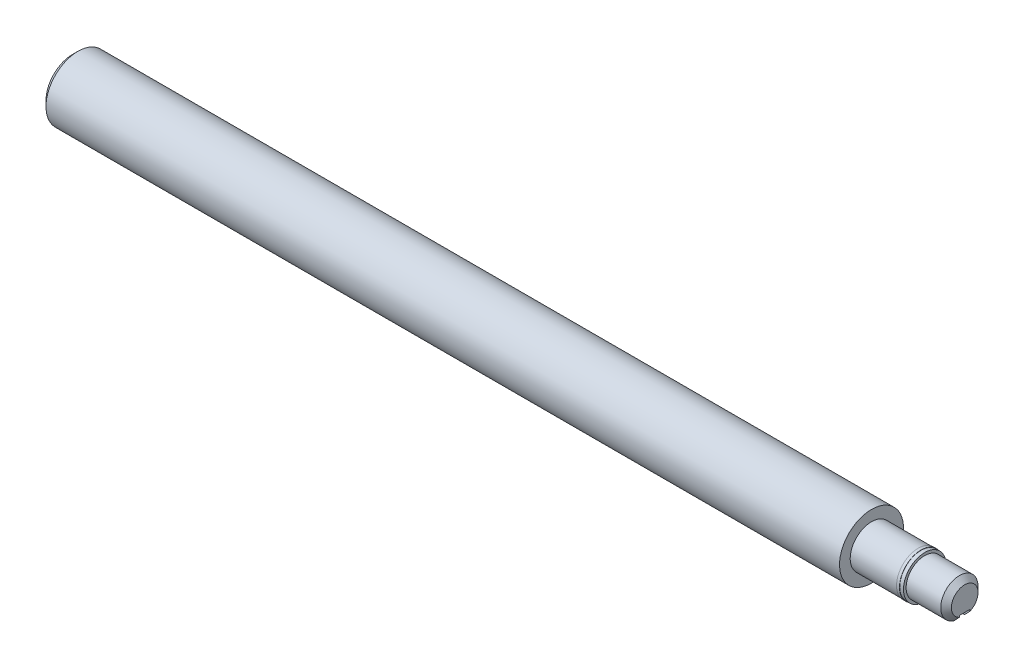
ISO-10303-21;
HEADER;
FILE_DESCRIPTION(('STEP AP214'),'2;1');
FILE_NAME('part.step','',(''),(''),'','','');
FILE_SCHEMA(('AUTOMOTIVE_DESIGN { 1 0 10303 214 1 1 1 1 }'));
ENDSEC;
DATA;
#1=APPLICATION_CONTEXT('core data for automotive mechanical design processes');
#2=APPLICATION_PROTOCOL_DEFINITION('international standard','automotive_design',2000,#1);
#3=PRODUCT_CONTEXT('',#1,'mechanical');
#4=PRODUCT('Part','Part','',(#3));
#5=PRODUCT_RELATED_PRODUCT_CATEGORY('part','',(#4));
#6=PRODUCT_DEFINITION_FORMATION('','',#4);
#7=PRODUCT_DEFINITION_CONTEXT('part definition',#1,'design');
#8=PRODUCT_DEFINITION('design','',#6,#7);
#9=PRODUCT_DEFINITION_SHAPE('','',#8);
#10=(LENGTH_UNIT() NAMED_UNIT(*) SI_UNIT(.MILLI.,.METRE.));
#11=(NAMED_UNIT(*) PLANE_ANGLE_UNIT() SI_UNIT($,.RADIAN.));
#12=(NAMED_UNIT(*) SI_UNIT($,.STERADIAN.) SOLID_ANGLE_UNIT());
#13=UNCERTAINTY_MEASURE_WITH_UNIT(LENGTH_MEASURE(1.E-05),#10,'distance_accuracy_value','');
#14=(GEOMETRIC_REPRESENTATION_CONTEXT(3) GLOBAL_UNCERTAINTY_ASSIGNED_CONTEXT((#13)) GLOBAL_UNIT_ASSIGNED_CONTEXT((#10,
#11,#12)) REPRESENTATION_CONTEXT('',''));
#15=CARTESIAN_POINT('',(0.,0.,0.));
#16=DIRECTION('',(0.,0.,1.));
#17=DIRECTION('',(1.,0.,0.));
#18=AXIS2_PLACEMENT_3D('',#15,#16,#17);
#19=CARTESIAN_POINT('',(335.,3.50000000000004,0.));
#20=DIRECTION('',(1.,0.,0.));
#21=DIRECTION('',(0.,0.,-1.));
#22=AXIS2_PLACEMENT_3D('',#19,#20,#21);
#23=PLANE('',#22);
#24=CARTESIAN_POINT('',(335.000000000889,0.,0.));
#25=DIRECTION('',(-1.,0.,0.));
#26=DIRECTION('',(0.,0.,1.));
#27=AXIS2_PLACEMENT_3D('',#24,#25,#26);
#28=CIRCLE('',#27,5.00000000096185);
#29=CARTESIAN_POINT('',(335.000000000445,-4.58257569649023,2.00000000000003));
#30=VERTEX_POINT('',#29);
#31=CARTESIAN_POINT('',(335.000000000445,-4.58257569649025,-1.99999999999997));
#32=VERTEX_POINT('',#31);
#33=EDGE_CURVE('E84',#30,#32,#28,.T.);
#34=ORIENTED_EDGE('',*,*,#33,.F.);
#35=DIRECTION('',(0.,1.,0.));
#36=VECTOR('',#35,1.);
#37=CARTESIAN_POINT('',(335.,-6.99999999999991,2.00000000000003));
#38=LINE('',#37,#36);
#39=CARTESIAN_POINT('',(335.,-3.99999999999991,2.00000000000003));
#40=VERTEX_POINT('',#39);
#41=EDGE_CURVE('E83',#30,#40,#38,.T.);
#42=ORIENTED_EDGE('',*,*,#41,.T.);
#43=DIRECTION('',(0.,0.,1.));
#44=VECTOR('',#43,1.);
#45=CARTESIAN_POINT('',(335.,-3.99999999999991,0.));
#46=LINE('',#45,#44);
#47=CARTESIAN_POINT('',(335.,-3.99999999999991,-1.99999999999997));
#48=VERTEX_POINT('',#47);
#49=EDGE_CURVE('E110',#40,#48,#46,.F.);
#50=ORIENTED_EDGE('',*,*,#49,.T.);
#51=DIRECTION('',(0.,1.,0.));
#52=VECTOR('',#51,1.);
#53=CARTESIAN_POINT('',(335.,3.50000000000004,-1.99999999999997));
#54=LINE('',#53,#52);
#55=EDGE_CURVE('E113',#48,#32,#54,.F.);
#56=ORIENTED_EDGE('',*,*,#55,.T.);
#57=EDGE_LOOP('',(#34,#42,#50,#56));
#58=FACE_BOUND('',#57,.T.);
#59=ADVANCED_FACE('F16',(#58),#23,.T.);
#60=CARTESIAN_POINT('',(329.787704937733,-3.99999999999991,0.));
#61=DIRECTION('',(0.,1.,0.));
#62=DIRECTION('',(0.,0.,1.));
#63=AXIS2_PLACEMENT_3D('',#60,#61,#62);
#64=PLANE('',#63);
#65=DIRECTION('',(1.,0.,0.));
#66=VECTOR('',#65,1.);
#67=CARTESIAN_POINT('',(337.815182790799,-3.99999999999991,2.00000000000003));
#68=LINE('',#67,#66);
#69=CARTESIAN_POINT('',(323.,-3.99999999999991,2.00000000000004));
#70=VERTEX_POINT('',#69);
#71=EDGE_CURVE('E85',#40,#70,#68,.F.);
#72=ORIENTED_EDGE('',*,*,#71,.T.);
#73=CARTESIAN_POINT('',(323.,-3.99999999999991,0.));
#74=DIRECTION('',(0.,1.,0.));
#75=DIRECTION('',(0.,0.,1.));
#76=AXIS2_PLACEMENT_3D('',#73,#74,#75);
#77=CIRCLE('',#76,2.);
#78=CARTESIAN_POINT('',(323.,-3.99999999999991,-1.99999999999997));
#79=VERTEX_POINT('',#78);
#80=EDGE_CURVE('E91',#70,#79,#77,.F.);
#81=ORIENTED_EDGE('',*,*,#80,.T.);
#82=DIRECTION('',(-1.,0.,0.));
#83=VECTOR('',#82,1.);
#84=CARTESIAN_POINT('',(323.,-3.99999999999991,-1.99999999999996));
#85=LINE('',#84,#83);
#86=EDGE_CURVE('E102',#79,#48,#85,.F.);
#87=ORIENTED_EDGE('',*,*,#86,.T.);
#88=ORIENTED_EDGE('',*,*,#49,.F.);
#89=EDGE_LOOP('',(#72,#81,#87,#88));
#90=FACE_BOUND('',#89,.T.);
#91=ADVANCED_FACE('F212',(#90),#64,.F.);
#92=CARTESIAN_POINT('',(337.815182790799,-6.99999999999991,2.00000000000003));
#93=DIRECTION('',(0.,0.,1.));
#94=DIRECTION('',(1.,0.,0.));
#95=AXIS2_PLACEMENT_3D('',#92,#93,#94);
#96=PLANE('',#95);
#97=DIRECTION('',(0.,1.,0.));
#98=VECTOR('',#97,1.);
#99=CARTESIAN_POINT('',(323.,-6.99999999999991,2.00000000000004));
#100=LINE('',#99,#98);
#101=CARTESIAN_POINT('',(323.,-6.70820393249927,2.00000000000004));
#102=VERTEX_POINT('',#101);
#103=EDGE_CURVE('E95',#102,#70,#100,.T.);
#104=ORIENTED_EDGE('',*,*,#103,.T.);
#105=ORIENTED_EDGE('',*,*,#71,.F.);
#106=ORIENTED_EDGE('',*,*,#41,.F.);
#107=CARTESIAN_POINT('',(332.99999999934,-6.70820393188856,2.00000000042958));
#108=CARTESIAN_POINT('',(333.168277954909,-6.53258975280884,2.00000000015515));
#109=CARTESIAN_POINT('',(333.336291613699,-6.35672115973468,2.00000000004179));
#110=CARTESIAN_POINT('',(333.671595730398,-6.0043059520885,1.99999999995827));
#111=CARTESIAN_POINT('',(333.838886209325,-5.82775935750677,1.9999999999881));
#112=CARTESIAN_POINT('',(334.172561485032,-5.47380630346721,2.00000000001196));
#113=CARTESIAN_POINT('',(334.338946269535,-5.29639983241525,2.000000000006));
#114=CARTESIAN_POINT('',(334.670482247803,-4.94042885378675,1.99999999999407));
#115=CARTESIAN_POINT('',(334.835633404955,-4.76186431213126,1.9999999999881));
#116=CARTESIAN_POINT('',(335.000000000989,-4.58257569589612,2.00000000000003));
#117=B_SPLINE_CURVE_WITH_KNOTS('',3,(#107,#108,#109,#110,#111,#112,#113,#114,#115,#116),
.UNSPECIFIED.,.F.,.F.,(4,2,2,2,4),(0.,0.729672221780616,1.45932309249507,2.18898382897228,
2.91866613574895),.UNSPECIFIED.);
#118=CARTESIAN_POINT('',(332.999999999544,-6.70820393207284,2.00000000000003));
#119=VERTEX_POINT('',#118);
#120=EDGE_CURVE('E20',#119,#30,#117,.T.);
#121=ORIENTED_EDGE('',*,*,#120,.F.);
#122=DIRECTION('',(1.,0.,0.));
#123=VECTOR('',#122,1.);
#124=CARTESIAN_POINT('',(327.5,-6.70820393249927,2.00000000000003));
#125=LINE('',#124,#123);
#126=EDGE_CURVE('E74',#102,#119,#125,.T.);
#127=ORIENTED_EDGE('',*,*,#126,.F.);
#128=EDGE_LOOP('',(#104,#105,#106,#121,#127));
#129=FACE_BOUND('',#128,.T.);
#130=ADVANCED_FACE('F80',(#129),#96,.F.);
#131=CARTESIAN_POINT('',(332.999999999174,0.,0.));
#132=DIRECTION('',(-1.,0.,0.));
#133=DIRECTION('',(0.,0.,1.));
#134=AXIS2_PLACEMENT_3D('',#131,#132,#133);
#135=CONICAL_SURFACE('',#134,6.99999999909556,0.785398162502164);
#136=CARTESIAN_POINT('',(335.000000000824,-4.58257569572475,-1.99999999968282));
#137=CARTESIAN_POINT('',(334.835633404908,-4.76186431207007,-1.99999999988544));
#138=CARTESIAN_POINT('',(334.670482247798,-4.94042885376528,-1.99999999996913));
#139=CARTESIAN_POINT('',(334.338946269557,-5.29639983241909,-2.0000000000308));
#140=CARTESIAN_POINT('',(334.172561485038,-5.47380630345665,-2.00000000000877));
#141=CARTESIAN_POINT('',(333.838886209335,-5.82775935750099,-1.99999999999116));
#142=CARTESIAN_POINT('',(333.671595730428,-6.0043059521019,-1.99999999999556));
#143=CARTESIAN_POINT('',(333.336291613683,-6.35672115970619,-2.00000000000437));
#144=CARTESIAN_POINT('',(333.168277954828,-6.53258975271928,-2.00000000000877));
#145=CARTESIAN_POINT('',(332.999999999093,-6.7082039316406,-1.99999999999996));
#146=B_SPLINE_CURVE_WITH_KNOTS('',3,(#136,#137,#138,#139,#140,#141,#142,#143,#144,#145),
.UNSPECIFIED.,.F.,.F.,(4,2,2,2,4),(0.,0.729682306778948,1.45934304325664,2.18899391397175,
2.91866613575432),.UNSPECIFIED.);
#147=CARTESIAN_POINT('',(332.999999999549,-6.70820393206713,-1.99999999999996));
#148=VERTEX_POINT('',#147);
#149=EDGE_CURVE('E69',#32,#148,#146,.T.);
#150=ORIENTED_EDGE('',*,*,#149,.T.);
#151=CARTESIAN_POINT('',(333.,0.,0.));
#152=DIRECTION('',(1.,0.,0.));
#153=DIRECTION('',(0.,1.,0.));
#154=AXIS2_PLACEMENT_3D('',#151,#152,#153);
#155=CIRCLE('',#154,6.99999999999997);
#156=EDGE_CURVE('E64',#119,#148,#155,.F.);
#157=ORIENTED_EDGE('',*,*,#156,.F.);
#158=ORIENTED_EDGE('',*,*,#120,.T.);
#159=ORIENTED_EDGE('',*,*,#33,.T.);
#160=EDGE_LOOP('',(#150,#157,#158,#159));
#161=FACE_BOUND('',#160,.T.);
#162=ADVANCED_FACE('F66',(#161),#135,.T.);
#163=CARTESIAN_POINT('',(323.,-6.99999999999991,-1.99999999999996));
#164=DIRECTION('',(0.,0.,-1.));
#165=DIRECTION('',(-1.,0.,0.));
#166=AXIS2_PLACEMENT_3D('',#163,#164,#165);
#167=PLANE('',#166);
#168=ORIENTED_EDGE('',*,*,#149,.F.);
#169=ORIENTED_EDGE('',*,*,#55,.F.);
#170=ORIENTED_EDGE('',*,*,#86,.F.);
#171=DIRECTION('',(0.,1.,0.));
#172=VECTOR('',#171,1.);
#173=CARTESIAN_POINT('',(323.,-6.99999999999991,-1.99999999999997));
#174=LINE('',#173,#172);
#175=CARTESIAN_POINT('',(323.,-6.70820393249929,-1.99999999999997));
#176=VERTEX_POINT('',#175);
#177=EDGE_CURVE('E40',#79,#176,#174,.F.);
#178=ORIENTED_EDGE('',*,*,#177,.T.);
#179=DIRECTION('',(1.,0.,0.));
#180=VECTOR('',#179,1.);
#181=CARTESIAN_POINT('',(327.5,-6.70820393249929,-1.99999999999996));
#182=LINE('',#181,#180);
#183=EDGE_CURVE('E73',#148,#176,#182,.F.);
#184=ORIENTED_EDGE('',*,*,#183,.F.);
#185=EDGE_LOOP('',(#168,#169,#170,#178,#184));
#186=FACE_BOUND('',#185,.T.);
#187=ADVANCED_FACE('F204',(#186),#167,.F.);
#188=CARTESIAN_POINT('',(323.,-6.99999999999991,0.));
#189=DIRECTION('',(0.,1.,0.));
#190=DIRECTION('',(0.,0.,1.));
#191=AXIS2_PLACEMENT_3D('',#188,#189,#190);
#192=CYLINDRICAL_SURFACE('',#191,2.);
#193=CARTESIAN_POINT('',(323.,-6.70820393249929,-1.99999999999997));
#194=CARTESIAN_POINT('',(322.944965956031,-6.70819953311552,-2.00000099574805));
#195=CARTESIAN_POINT('',(322.889959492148,-6.70888204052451,-1.99772698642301));
#196=CARTESIAN_POINT('',(322.780363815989,-6.71157572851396,-1.98866402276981));
#197=CARTESIAN_POINT('',(322.725774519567,-6.71358663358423,-1.98187600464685));
#198=CARTESIAN_POINT('',(322.563492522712,-6.7215274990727,-1.95485063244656));
#199=CARTESIAN_POINT('',(322.456924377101,-6.7293661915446,-1.927951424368));
#200=CARTESIAN_POINT('',(322.250058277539,-6.74920546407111,-1.85729706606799));
#201=CARTESIAN_POINT('',(322.149758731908,-6.76120498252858,-1.81354621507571));
#202=CARTESIAN_POINT('',(321.957860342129,-6.78800553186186,-1.71049896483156));
#203=CARTESIAN_POINT('',(321.866264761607,-6.80280760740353,-1.65119676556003));
#204=CARTESIAN_POINT('',(321.691817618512,-6.83401592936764,-1.51693301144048));
#205=CARTESIAN_POINT('',(321.609251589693,-6.85045364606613,-1.44160788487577));
#206=CARTESIAN_POINT('',(321.457713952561,-6.88281585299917,-1.27819153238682));
#207=CARTESIAN_POINT('',(321.38874717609,-6.89874015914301,-1.19009578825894));
#208=CARTESIAN_POINT('',(321.26513970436,-6.92864106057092,-1.00160024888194));
#209=CARTESIAN_POINT('',(321.2107959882,-6.94257491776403,-0.900998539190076));
#210=CARTESIAN_POINT('',(321.119959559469,-6.96653558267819,-0.691686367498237));
#211=CARTESIAN_POINT('',(321.08344524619,-6.97656711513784,-0.582985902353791));
#212=CARTESIAN_POINT('',(321.037748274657,-6.98928636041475,-0.394805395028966));
#213=CARTESIAN_POINT('',(321.023618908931,-6.99328251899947,-0.316579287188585));
#214=CARTESIAN_POINT('',(321.004743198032,-6.99864042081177,-0.158912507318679));
#215=CARTESIAN_POINT('',(320.999996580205,-7.00000224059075,-0.0794718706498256));
#216=CARTESIAN_POINT('',(321.000004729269,-6.99999690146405,0.109902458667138));
#217=CARTESIAN_POINT('',(321.009093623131,-6.99738511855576,0.219864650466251));
#218=CARTESIAN_POINT('',(321.045149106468,-6.98721356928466,0.436640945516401));
#219=CARTESIAN_POINT('',(321.072132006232,-6.97964928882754,0.54345208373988));
#220=CARTESIAN_POINT('',(321.143009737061,-6.96040637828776,0.750707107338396));
#221=CARTESIAN_POINT('',(321.186877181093,-6.94873441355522,0.851160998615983));
#222=CARTESIAN_POINT('',(321.290183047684,-6.92249857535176,1.04327701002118));
#223=CARTESIAN_POINT('',(321.349621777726,-6.90793464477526,1.13493895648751));
#224=CARTESIAN_POINT('',(321.484033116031,-6.87704774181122,1.30929206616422));
#225=CARTESIAN_POINT('',(321.559340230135,-6.86069128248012,1.39171940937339));
#226=CARTESIAN_POINT('',(321.722644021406,-6.82826812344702,1.5429680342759));
#227=CARTESIAN_POINT('',(321.810643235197,-6.81220148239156,1.61178658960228));
#228=CARTESIAN_POINT('',(321.999020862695,-6.78182545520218,1.73521711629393));
#229=CARTESIAN_POINT('',(322.099615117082,-6.76755858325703,1.7895107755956));
#230=CARTESIAN_POINT('',(322.308951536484,-6.74290625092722,1.88027667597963));
#231=CARTESIAN_POINT('',(322.41768673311,-6.73251751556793,1.91676396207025));
#232=CARTESIAN_POINT('',(322.605808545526,-6.71933727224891,1.9623687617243));
#233=CARTESIAN_POINT('',(322.683931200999,-6.7151917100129,1.97645330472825));
#234=CARTESIAN_POINT('',(322.841353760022,-6.70961199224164,1.99527750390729));
#235=CARTESIAN_POINT('',(322.920653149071,-6.70817668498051,2.00002112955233));
#236=CARTESIAN_POINT('',(323.,-6.70820393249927,2.00000000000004));
#237=B_SPLINE_CURVE_WITH_KNOTS('',3,(#193,#194,#195,#196,#197,#198,#199,#200,#201,#202,#203,
#204,#205,#206,#207,#208,#209,#210,#211,#212,#213,#214,#215,#216,#217,#218,#219,#220,#221,#222,
#223,#224,#225,#226,#227,#228,#229,#230,#231,#232,#233,#234,#235,#236),.UNSPECIFIED.,.F.,.F.,(4,
2,2,2,2,2,2,2,2,2,2,2,2,2,2,2,2,2,2,2,2,4),(0.,0.164996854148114,0.329959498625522,
0.658815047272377,0.987586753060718,1.31648125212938,1.65383602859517,1.99131045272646,
2.33519463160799,2.67866114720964,2.91686961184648,3.15507115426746,3.48448249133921,
3.81419449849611,4.14337394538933,4.47255989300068,4.8095407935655,5.14658913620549,
5.49051045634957,5.83414068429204,6.0720400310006,6.30983825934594),.UNSPECIFIED.);
#238=EDGE_CURVE('E88',#176,#102,#237,.T.);
#239=ORIENTED_EDGE('',*,*,#238,.F.);
#240=ORIENTED_EDGE('',*,*,#177,.F.);
#241=ORIENTED_EDGE('',*,*,#80,.F.);
#242=ORIENTED_EDGE('',*,*,#103,.F.);
#243=EDGE_LOOP('',(#239,#240,#241,#242));
#244=FACE_BOUND('',#243,.T.);
#245=ADVANCED_FACE('F146',(#244),#192,.F.);
#246=CARTESIAN_POINT('',(327.5,0.,0.));
#247=DIRECTION('',(1.,0.,0.));
#248=DIRECTION('',(0.,1.,0.));
#249=AXIS2_PLACEMENT_3D('',#246,#247,#248);
#250=CYLINDRICAL_SURFACE('',#249,6.99999999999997);
#251=ORIENTED_EDGE('',*,*,#126,.T.);
#252=ORIENTED_EDGE('',*,*,#156,.T.);
#253=ORIENTED_EDGE('',*,*,#183,.T.);
#254=ORIENTED_EDGE('',*,*,#238,.T.);
#255=EDGE_LOOP('',(#251,#252,#253,#254));
#256=FACE_BOUND('',#255,.T.);
#257=CARTESIAN_POINT('',(320.,0.,0.));
#258=DIRECTION('',(1.,0.,0.));
#259=DIRECTION('',(0.,1.,0.));
#260=AXIS2_PLACEMENT_3D('',#257,#258,#259);
#261=CIRCLE('',#260,6.99999999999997);
#262=CARTESIAN_POINT('',(320.,7.00000000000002,0.));
#263=VERTEX_POINT('',#262);
#264=EDGE_CURVE('E136',#263,#263,#261,.F.);
#265=ORIENTED_EDGE('',*,*,#264,.F.);
#266=EDGE_LOOP('',(#265));
#267=FACE_BOUND('',#266,.T.);
#268=ADVANCED_FACE('F86',(#256,#267),#250,.T.);
#269=CARTESIAN_POINT('',(320.,7.50000000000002,0.));
#270=DIRECTION('',(1.,0.,0.));
#271=DIRECTION('',(0.,0.,-1.));
#272=AXIS2_PLACEMENT_3D('',#269,#270,#271);
#273=PLANE('',#272);
#274=ORIENTED_EDGE('',*,*,#264,.T.);
#275=EDGE_LOOP('',(#274));
#276=FACE_BOUND('',#275,.T.);
#277=CARTESIAN_POINT('',(320.,0.,0.));
#278=DIRECTION('',(1.,0.,0.));
#279=DIRECTION('',(0.,1.,0.));
#280=AXIS2_PLACEMENT_3D('',#277,#278,#279);
#281=CIRCLE('',#280,7.99999999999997);
#282=CARTESIAN_POINT('',(320.,8.00000000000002,0.));
#283=VERTEX_POINT('',#282);
#284=EDGE_CURVE('E133',#283,#283,#281,.F.);
#285=ORIENTED_EDGE('',*,*,#284,.F.);
#286=EDGE_LOOP('',(#285));
#287=FACE_BOUND('',#286,.T.);
#288=ADVANCED_FACE('F152',(#276,#287),#273,.T.);
#289=CARTESIAN_POINT('',(319.3,0.,0.));
#290=DIRECTION('',(1.,0.,0.));
#291=DIRECTION('',(0.,1.,0.));
#292=AXIS2_PLACEMENT_3D('',#289,#290,#291);
#293=CYLINDRICAL_SURFACE('',#292,7.99999999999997);
#294=ORIENTED_EDGE('',*,*,#284,.T.);
#295=EDGE_LOOP('',(#294));
#296=FACE_BOUND('',#295,.T.);
#297=CARTESIAN_POINT('',(318.6,0.,0.));
#298=DIRECTION('',(1.,0.,0.));
#299=DIRECTION('',(0.,1.,0.));
#300=AXIS2_PLACEMENT_3D('',#297,#298,#299);
#301=CIRCLE('',#300,7.99999999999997);
#302=CARTESIAN_POINT('',(318.6,8.00000000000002,0.));
#303=VERTEX_POINT('',#302);
#304=EDGE_CURVE('E130',#303,#303,#301,.F.);
#305=ORIENTED_EDGE('',*,*,#304,.F.);
#306=EDGE_LOOP('',(#305));
#307=FACE_BOUND('',#306,.T.);
#308=ADVANCED_FACE('F155',(#296,#307),#293,.T.);
#309=CARTESIAN_POINT('',(318.6,8.05000000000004,0.));
#310=DIRECTION('',(1.,0.,0.));
#311=DIRECTION('',(0.,0.,-1.));
#312=AXIS2_PLACEMENT_3D('',#309,#310,#311);
#313=PLANE('',#312);
#314=ORIENTED_EDGE('',*,*,#304,.T.);
#315=EDGE_LOOP('',(#314));
#316=FACE_BOUND('',#315,.T.);
#317=CARTESIAN_POINT('',(318.6,0.,0.));
#318=DIRECTION('',(1.,0.,0.));
#319=DIRECTION('',(0.,1.,0.));
#320=AXIS2_PLACEMENT_3D('',#317,#318,#319);
#321=CIRCLE('',#320,8.1);
#322=CARTESIAN_POINT('',(318.6,8.10000000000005,0.));
#323=VERTEX_POINT('',#322);
#324=EDGE_CURVE('E127',#323,#323,#321,.F.);
#325=ORIENTED_EDGE('',*,*,#324,.F.);
#326=EDGE_LOOP('',(#325));
#327=FACE_BOUND('',#326,.T.);
#328=ADVANCED_FACE('F159',(#316,#327),#313,.T.);
#329=CARTESIAN_POINT('',(318.05,0.,0.));
#330=DIRECTION('',(1.,0.,0.));
#331=DIRECTION('',(0.,1.,0.));
#332=AXIS2_PLACEMENT_3D('',#329,#330,#331);
#333=CYLINDRICAL_SURFACE('',#332,8.1);
#334=ORIENTED_EDGE('',*,*,#324,.T.);
#335=EDGE_LOOP('',(#334));
#336=FACE_BOUND('',#335,.T.);
#337=CARTESIAN_POINT('',(317.5,0.,0.));
#338=DIRECTION('',(1.,0.,0.));
#339=DIRECTION('',(0.,1.,0.));
#340=AXIS2_PLACEMENT_3D('',#337,#338,#339);
#341=CIRCLE('',#340,8.1);
#342=CARTESIAN_POINT('',(317.5,8.10000000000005,0.));
#343=VERTEX_POINT('',#342);
#344=EDGE_CURVE('E124',#343,#343,#341,.F.);
#345=ORIENTED_EDGE('',*,*,#344,.F.);
#346=EDGE_LOOP('',(#345));
#347=FACE_BOUND('',#346,.T.);
#348=ADVANCED_FACE('F163',(#336,#347),#333,.T.);
#349=CARTESIAN_POINT('',(317.5,8.05000000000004,0.));
#350=DIRECTION('',(-1.,0.,0.));
#351=DIRECTION('',(0.,0.,1.));
#352=AXIS2_PLACEMENT_3D('',#349,#350,#351);
#353=PLANE('',#352);
#354=CARTESIAN_POINT('',(317.5,0.,0.));
#355=DIRECTION('',(1.,0.,0.));
#356=DIRECTION('',(0.,1.,0.));
#357=AXIS2_PLACEMENT_3D('',#354,#355,#356);
#358=CIRCLE('',#357,7.99999999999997);
#359=CARTESIAN_POINT('',(317.5,8.00000000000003,0.));
#360=VERTEX_POINT('',#359);
#361=EDGE_CURVE('E121',#360,#360,#358,.F.);
#362=ORIENTED_EDGE('',*,*,#361,.F.);
#363=EDGE_LOOP('',(#362));
#364=FACE_BOUND('',#363,.T.);
#365=ORIENTED_EDGE('',*,*,#344,.T.);
#366=EDGE_LOOP('',(#365));
#367=FACE_BOUND('',#366,.T.);
#368=ADVANCED_FACE('F167',(#364,#367),#353,.T.);
#369=CARTESIAN_POINT('',(0.,6.,0.));
#370=DIRECTION('',(-1.,0.,0.));
#371=DIRECTION('',(0.,0.,1.));
#372=AXIS2_PLACEMENT_3D('',#369,#370,#371);
#373=PLANE('',#372);
#374=CARTESIAN_POINT('',(-8.97447047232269E-10,0.,0.));
#375=DIRECTION('',(1.,0.,0.));
#376=DIRECTION('',(0.,1.,0.));
#377=AXIS2_PLACEMENT_3D('',#374,#375,#376);
#378=CIRCLE('',#377,10.0000000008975);
#379=CARTESIAN_POINT('',(-8.97448673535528E-10,10.0000000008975,0.));
#380=VERTEX_POINT('',#379);
#381=EDGE_CURVE('E118',#380,#380,#378,.T.);
#382=ORIENTED_EDGE('',*,*,#381,.F.);
#383=EDGE_LOOP('',(#382));
#384=FACE_BOUND('',#383,.T.);
#385=ADVANCED_FACE('F171',(#384),#373,.T.);
#386=CARTESIAN_POINT('',(308.75,0.,0.));
#387=DIRECTION('',(1.,0.,0.));
#388=DIRECTION('',(0.,1.,0.));
#389=AXIS2_PLACEMENT_3D('',#386,#387,#388);
#390=CYLINDRICAL_SURFACE('',#389,7.99999999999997);
#391=ORIENTED_EDGE('',*,*,#361,.T.);
#392=EDGE_LOOP('',(#391));
#393=FACE_BOUND('',#392,.T.);
#394=CARTESIAN_POINT('',(300.,0.,0.));
#395=DIRECTION('',(1.,0.,0.));
#396=DIRECTION('',(0.,1.,0.));
#397=AXIS2_PLACEMENT_3D('',#394,#395,#396);
#398=CIRCLE('',#397,7.99999999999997);
#399=CARTESIAN_POINT('',(300.,8.00000000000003,0.));
#400=VERTEX_POINT('',#399);
#401=EDGE_CURVE('E98',#400,#400,#398,.F.);
#402=ORIENTED_EDGE('',*,*,#401,.F.);
#403=EDGE_LOOP('',(#402));
#404=FACE_BOUND('',#403,.T.);
#405=ADVANCED_FACE('F175',(#393,#404),#390,.T.);
#406=CARTESIAN_POINT('',(2.00000000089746,0.,0.));
#407=DIRECTION('',(1.,0.,0.));
#408=DIRECTION('',(0.,1.,0.));
#409=AXIS2_PLACEMENT_3D('',#406,#407,#408);
#410=CONICAL_SURFACE('',#409,11.9999999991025,0.785398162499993);
#411=CARTESIAN_POINT('',(2.,0.,0.));
#412=DIRECTION('',(1.,0.,0.));
#413=DIRECTION('',(0.,1.,0.));
#414=AXIS2_PLACEMENT_3D('',#411,#412,#413);
#415=CIRCLE('',#414,12.);
#416=CARTESIAN_POINT('',(2.,12.,0.));
#417=VERTEX_POINT('',#416);
#418=EDGE_CURVE('E31',#417,#417,#415,.T.);
#419=ORIENTED_EDGE('',*,*,#418,.F.);
#420=EDGE_LOOP('',(#419));
#421=FACE_BOUND('',#420,.T.);
#422=ORIENTED_EDGE('',*,*,#381,.T.);
#423=EDGE_LOOP('',(#422));
#424=FACE_BOUND('',#423,.T.);
#425=ADVANCED_FACE('F179',(#421,#424),#410,.T.);
#426=CARTESIAN_POINT('',(300.,10.,0.));
#427=DIRECTION('',(1.,0.,0.));
#428=DIRECTION('',(0.,0.,-1.));
#429=AXIS2_PLACEMENT_3D('',#426,#427,#428);
#430=PLANE('',#429);
#431=ORIENTED_EDGE('',*,*,#401,.T.);
#432=EDGE_LOOP('',(#431));
#433=FACE_BOUND('',#432,.T.);
#434=CARTESIAN_POINT('',(300.,0.,0.));
#435=DIRECTION('',(1.,0.,0.));
#436=DIRECTION('',(0.,1.,0.));
#437=AXIS2_PLACEMENT_3D('',#434,#435,#436);
#438=CIRCLE('',#437,12.);
#439=CARTESIAN_POINT('',(300.,12.,0.));
#440=VERTEX_POINT('',#439);
#441=EDGE_CURVE('E10',#440,#440,#438,.F.);
#442=ORIENTED_EDGE('',*,*,#441,.F.);
#443=EDGE_LOOP('',(#442));
#444=FACE_BOUND('',#443,.T.);
#445=ADVANCED_FACE('F182',(#433,#444),#430,.T.);
#446=CARTESIAN_POINT('',(150.,0.,0.));
#447=DIRECTION('',(1.,0.,0.));
#448=DIRECTION('',(0.,1.,0.));
#449=AXIS2_PLACEMENT_3D('',#446,#447,#448);
#450=CYLINDRICAL_SURFACE('',#449,12.);
#451=ORIENTED_EDGE('',*,*,#418,.T.);
#452=EDGE_LOOP('',(#451));
#453=FACE_BOUND('',#452,.T.);
#454=ORIENTED_EDGE('',*,*,#441,.T.);
#455=EDGE_LOOP('',(#454));
#456=FACE_BOUND('',#455,.T.);
#457=ADVANCED_FACE('F18',(#453,#456),#450,.T.);
#458=CLOSED_SHELL('',(#59,#91,#130,#162,#187,#245,#268,#288,#308,#328,#348,#368,#385,#405,#425,
#445,#457));
#459=MANIFOLD_SOLID_BREP('B1',#458);
#460=ADVANCED_BREP_SHAPE_REPRESENTATION('',(#18,#459),#14);
#461=SHAPE_DEFINITION_REPRESENTATION(#9,#460);
ENDSEC;
END-ISO-10303-21;
